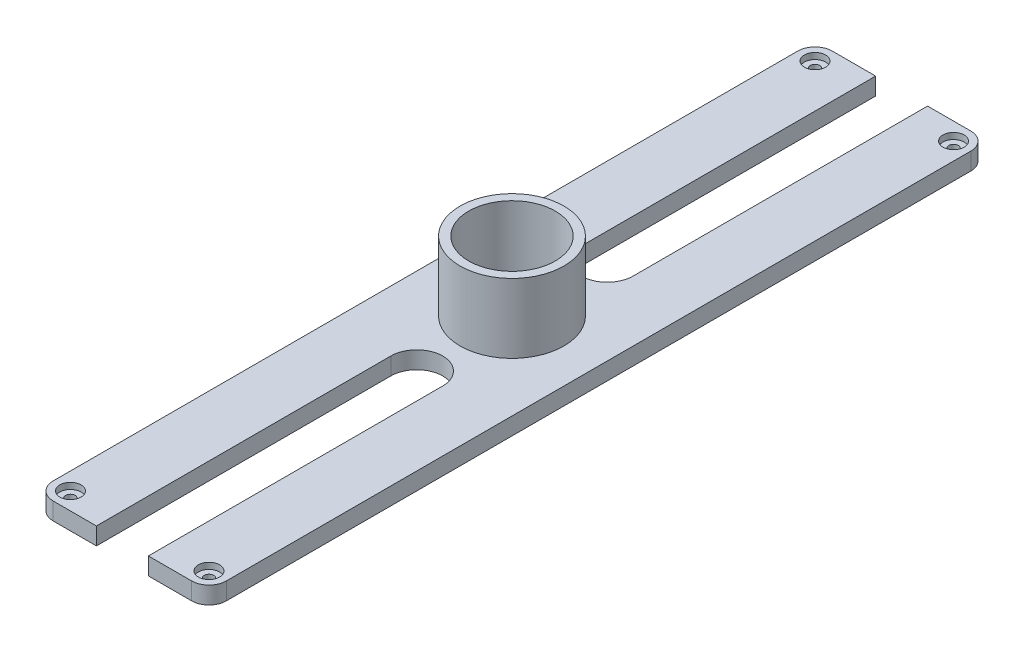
from build123d import *

# Parameters (mm, degrees)
EXTRUDE1_DEPTH                          = 10
CBORE_FOR_M5_HEX_HEAD_BOLT1_D           = 5.5
CBORE_FOR_M5_HEX_HEAD_BOLT1_CBORE_D     = 12.24
CBORE_FOR_M5_HEX_HEAD_BOLT1_CBORE_DEPTH = 3.58
SKETCH5_R                               = 30
SKETCH5_R_2                             = 25
EXTRUDE2_DEPTH                          = 40
CUT_EXTRUDE1_REACH                      = 464.709


with BuildPart() as part:
    # Sketch1 → Extrude1 (new body)
    with BuildSketch(Plane.ZX):
        with BuildLine():
            Line((10, 0), (440, 0))
            ThreePointArc((440, 0), (447.071067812, 2.928932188), (450, 10))
            Line((450, 10), (450, 90))
            ThreePointArc((450, 90), (447.071067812, 97.071067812), (440, 100))
            Line((440, 100), (10, 100))
            ThreePointArc((10, 100), (2.928932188, 97.071067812), (0, 90))
            Line((0, 90), (0, 10))
            ThreePointArc((0, 10), (2.928932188, 2.928932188), (10, 0))
        make_face()
    extrude(amount=EXTRUDE1_DEPTH)

    # CBORE for M5 Hex Head Bolt1 (through all)
    with Locations(Plane(origin=(0, 10, 0), x_dir=(-1, 0, 0), z_dir=(0, 1, 0))):
        with Locations((-90, 10), (-90, 440), (-10, 440), (-10, 10)):
            CounterBoreHole(CBORE_FOR_M5_HEX_HEAD_BOLT1_D / 2, CBORE_FOR_M5_HEX_HEAD_BOLT1_CBORE_D / 2, CBORE_FOR_M5_HEX_HEAD_BOLT1_CBORE_DEPTH)

    # Sketch5 → Extrude2 (add)
    with BuildSketch(Plane(origin=(0, 10, 0), x_dir=(-1, 0, 0), z_dir=(0, 1, 0))):
        with Locations(Location((-50, 225, 0), (0, 0, 90))):
            Circle(SKETCH5_R)
        with Locations(Location((-50, 225, 0), (0, 0, 90))):
            Circle(SKETCH5_R_2, mode=Mode.SUBTRACT)
    extrude(amount=EXTRUDE2_DEPTH)

    # Sketch6 → Cut-Extrude1 (cut, up to next)
    with BuildSketch(Plane(origin=(0, 10, 0), x_dir=(-1, 0, 0), z_dir=(0, 1, 0)), mode=Mode.PRIVATE) as cut_extrude1_sk1:
        with BuildLine():
            Line((-35, 0), (-35, 170))
            ThreePointArc((-35, 170), (-50, 185), (-65, 170))
            Line((-65, 170), (-65, 0))
            Line((-65, 0), (-35, 0))
        make_face()
    cut_extrude1_tool1 = extrude(cut_extrude1_sk1.sketch, amount=-CUT_EXTRUDE1_REACH, mode=Mode.PRIVATE) & part.part
    # Sketch6 → Cut-Extrude1 (cut, up to next)
    with BuildSketch(Plane(origin=(0, 10, 0), x_dir=(-1, 0, 0), z_dir=(0, 1, 0)), mode=Mode.PRIVATE) as cut_extrude1_sk2:
        with BuildLine():
            Line((-65, 450), (-35, 450))
            Line((-35, 450), (-35, 280))
            ThreePointArc((-35, 280), (-50, 265), (-65, 280))
            Line((-65, 280), (-65, 450))
        make_face()
    cut_extrude1_tool2 = extrude(cut_extrude1_sk2.sketch, amount=-CUT_EXTRUDE1_REACH, mode=Mode.PRIVATE) & part.part
    add(cut_extrude1_tool1.solids().sort_by_distance((50, 10, 90.921316))[0], mode=Mode.SUBTRACT)
    add(cut_extrude1_tool2.solids().sort_by_distance((50, 10, 359.078684))[0], mode=Mode.SUBTRACT)


solid = part.part
